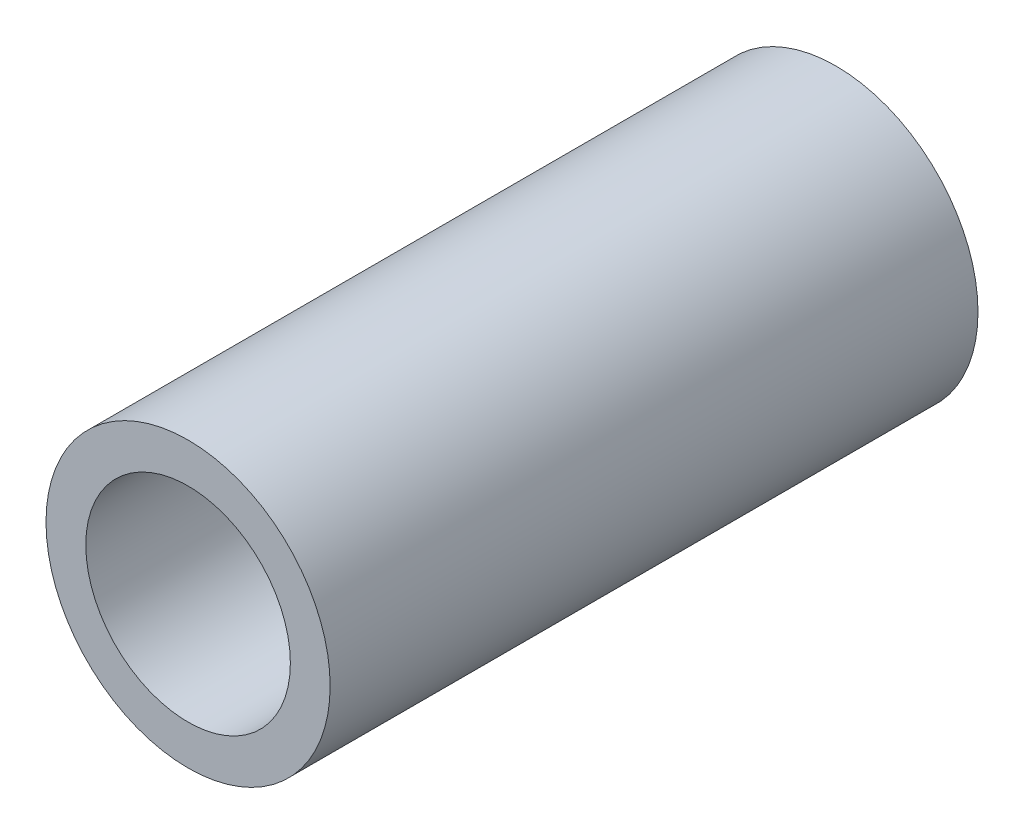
ISO-10303-21;
HEADER;
FILE_DESCRIPTION(('STEP AP214'),'2;1');
FILE_NAME('part.step','',(''),(''),'','','');
FILE_SCHEMA(('AUTOMOTIVE_DESIGN { 1 0 10303 214 1 1 1 1 }'));
ENDSEC;
DATA;
#1=APPLICATION_CONTEXT('core data for automotive mechanical design processes');
#2=APPLICATION_PROTOCOL_DEFINITION('international standard','automotive_design',2000,#1);
#3=PRODUCT_CONTEXT('',#1,'mechanical');
#4=PRODUCT('Part','Part','',(#3));
#5=PRODUCT_RELATED_PRODUCT_CATEGORY('part','',(#4));
#6=PRODUCT_DEFINITION_FORMATION('','',#4);
#7=PRODUCT_DEFINITION_CONTEXT('part definition',#1,'design');
#8=PRODUCT_DEFINITION('design','',#6,#7);
#9=PRODUCT_DEFINITION_SHAPE('','',#8);
#10=(LENGTH_UNIT() NAMED_UNIT(*) SI_UNIT(.MILLI.,.METRE.));
#11=(NAMED_UNIT(*) PLANE_ANGLE_UNIT() SI_UNIT($,.RADIAN.));
#12=(NAMED_UNIT(*) SI_UNIT($,.STERADIAN.) SOLID_ANGLE_UNIT());
#13=UNCERTAINTY_MEASURE_WITH_UNIT(LENGTH_MEASURE(1.E-05),#10,'distance_accuracy_value','');
#14=(GEOMETRIC_REPRESENTATION_CONTEXT(3) GLOBAL_UNCERTAINTY_ASSIGNED_CONTEXT((#13)) GLOBAL_UNIT_ASSIGNED_CONTEXT((#10,
#11,#12)) REPRESENTATION_CONTEXT('',''));
#15=CARTESIAN_POINT('',(0.,0.,0.));
#16=DIRECTION('',(0.,0.,1.));
#17=DIRECTION('',(1.,0.,0.));
#18=AXIS2_PLACEMENT_3D('',#15,#16,#17);
#19=CARTESIAN_POINT('',(0.,0.,28.5));
#20=DIRECTION('',(0.,0.,1.));
#21=DIRECTION('',(1.,0.,0.));
#22=AXIS2_PLACEMENT_3D('',#19,#20,#21);
#23=PLANE('',#22);
#24=CARTESIAN_POINT('',(0.,0.,28.5));
#25=DIRECTION('',(0.,0.,1.));
#26=DIRECTION('',(1.,0.,0.));
#27=AXIS2_PLACEMENT_3D('',#24,#25,#26);
#28=CIRCLE('',#27,12.5);
#29=CARTESIAN_POINT('',(-12.5,0.,28.5));
#30=VERTEX_POINT('',#29);
#31=EDGE_CURVE('E10',#30,#30,#28,.T.);
#32=ORIENTED_EDGE('',*,*,#31,.T.);
#33=EDGE_LOOP('',(#32));
#34=FACE_BOUND('',#33,.T.);
#35=CARTESIAN_POINT('',(0.,0.,28.5));
#36=DIRECTION('',(0.,0.,1.));
#37=DIRECTION('',(1.,0.,0.));
#38=AXIS2_PLACEMENT_3D('',#35,#36,#37);
#39=CIRCLE('',#38,9.);
#40=CARTESIAN_POINT('',(-9.,0.,28.5));
#41=VERTEX_POINT('',#40);
#42=EDGE_CURVE('E40',#41,#41,#39,.T.);
#43=ORIENTED_EDGE('',*,*,#42,.F.);
#44=EDGE_LOOP('',(#43));
#45=FACE_BOUND('',#44,.T.);
#46=ADVANCED_FACE('F29',(#34,#45),#23,.T.);
#47=CARTESIAN_POINT('',(0.,0.,-28.5));
#48=DIRECTION('',(0.,0.,1.));
#49=DIRECTION('',(1.,0.,0.));
#50=AXIS2_PLACEMENT_3D('',#47,#48,#49);
#51=PLANE('',#50);
#52=CARTESIAN_POINT('',(0.,0.,-28.5));
#53=DIRECTION('',(0.,0.,1.));
#54=DIRECTION('',(1.,0.,0.));
#55=AXIS2_PLACEMENT_3D('',#52,#53,#54);
#56=CIRCLE('',#55,12.5);
#57=CARTESIAN_POINT('',(-12.5,0.,-28.5));
#58=VERTEX_POINT('',#57);
#59=EDGE_CURVE('E33',#58,#58,#56,.T.);
#60=ORIENTED_EDGE('',*,*,#59,.F.);
#61=EDGE_LOOP('',(#60));
#62=FACE_BOUND('',#61,.T.);
#63=CARTESIAN_POINT('',(0.,0.,-28.5));
#64=DIRECTION('',(0.,0.,1.));
#65=DIRECTION('',(1.,0.,0.));
#66=AXIS2_PLACEMENT_3D('',#63,#64,#65);
#67=CIRCLE('',#66,9.);
#68=CARTESIAN_POINT('',(-9.,0.,-28.5));
#69=VERTEX_POINT('',#68);
#70=EDGE_CURVE('E42',#69,#69,#67,.T.);
#71=ORIENTED_EDGE('',*,*,#70,.T.);
#72=EDGE_LOOP('',(#71));
#73=FACE_BOUND('',#72,.T.);
#74=ADVANCED_FACE('F52',(#62,#73),#51,.F.);
#75=CARTESIAN_POINT('',(0.,0.,28.5));
#76=DIRECTION('',(0.,0.,-1.));
#77=DIRECTION('',(-1.,0.,0.));
#78=AXIS2_PLACEMENT_3D('',#75,#76,#77);
#79=CYLINDRICAL_SURFACE('',#78,12.5);
#80=CARTESIAN_POINT('',(-12.5,0.,28.5));
#81=CARTESIAN_POINT('',(-12.5,0.,27.90625));
#82=CARTESIAN_POINT('',(-12.5,0.,27.3125));
#83=CARTESIAN_POINT('',(-12.5,0.,26.125));
#84=CARTESIAN_POINT('',(-12.5,0.,25.53125));
#85=CARTESIAN_POINT('',(-12.5,0.,24.34375));
#86=CARTESIAN_POINT('',(-12.5,0.,23.75));
#87=CARTESIAN_POINT('',(-12.5,0.,22.5625));
#88=CARTESIAN_POINT('',(-12.5,0.,21.96875));
#89=CARTESIAN_POINT('',(-12.5,0.,20.78125));
#90=CARTESIAN_POINT('',(-12.5,0.,20.1875));
#91=CARTESIAN_POINT('',(-12.5,0.,19.));
#92=CARTESIAN_POINT('',(-12.5,0.,18.40625));
#93=CARTESIAN_POINT('',(-12.5,0.,17.21875));
#94=CARTESIAN_POINT('',(-12.5,0.,16.625));
#95=CARTESIAN_POINT('',(-12.5,0.,15.4375));
#96=CARTESIAN_POINT('',(-12.5,0.,14.84375));
#97=CARTESIAN_POINT('',(-12.5,0.,13.65625));
#98=CARTESIAN_POINT('',(-12.5,0.,13.0625));
#99=CARTESIAN_POINT('',(-12.5,0.,11.875));
#100=CARTESIAN_POINT('',(-12.5,0.,11.28125));
#101=CARTESIAN_POINT('',(-12.5,0.,10.09375));
#102=CARTESIAN_POINT('',(-12.5,0.,9.5));
#103=CARTESIAN_POINT('',(-12.5,0.,8.3125));
#104=CARTESIAN_POINT('',(-12.5,0.,7.71875));
#105=CARTESIAN_POINT('',(-12.5,0.,6.53125));
#106=CARTESIAN_POINT('',(-12.5,0.,5.9375));
#107=CARTESIAN_POINT('',(-12.5,0.,4.75));
#108=CARTESIAN_POINT('',(-12.5,0.,4.15625));
#109=CARTESIAN_POINT('',(-12.5,0.,2.96875));
#110=CARTESIAN_POINT('',(-12.5,0.,2.375));
#111=CARTESIAN_POINT('',(-12.5,0.,1.1875));
#112=CARTESIAN_POINT('',(-12.5,0.,0.593750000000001));
#113=CARTESIAN_POINT('',(-12.5,0.,-0.593750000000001));
#114=CARTESIAN_POINT('',(-12.5,0.,-1.1875));
#115=CARTESIAN_POINT('',(-12.5,0.,-2.375));
#116=CARTESIAN_POINT('',(-12.5,0.,-2.96875));
#117=CARTESIAN_POINT('',(-12.5,0.,-4.15625));
#118=CARTESIAN_POINT('',(-12.5,0.,-4.75));
#119=CARTESIAN_POINT('',(-12.5,0.,-5.9375));
#120=CARTESIAN_POINT('',(-12.5,0.,-6.53125));
#121=CARTESIAN_POINT('',(-12.5,0.,-7.71875));
#122=CARTESIAN_POINT('',(-12.5,0.,-8.3125));
#123=CARTESIAN_POINT('',(-12.5,0.,-9.5));
#124=CARTESIAN_POINT('',(-12.5,0.,-10.09375));
#125=CARTESIAN_POINT('',(-12.5,0.,-11.28125));
#126=CARTESIAN_POINT('',(-12.5,0.,-11.875));
#127=CARTESIAN_POINT('',(-12.5,0.,-13.0625));
#128=CARTESIAN_POINT('',(-12.5,0.,-13.65625));
#129=CARTESIAN_POINT('',(-12.5,0.,-14.84375));
#130=CARTESIAN_POINT('',(-12.5,0.,-15.4375));
#131=CARTESIAN_POINT('',(-12.5,0.,-16.625));
#132=CARTESIAN_POINT('',(-12.5,0.,-17.21875));
#133=CARTESIAN_POINT('',(-12.5,0.,-18.40625));
#134=CARTESIAN_POINT('',(-12.5,0.,-19.));
#135=CARTESIAN_POINT('',(-12.5,0.,-20.1875));
#136=CARTESIAN_POINT('',(-12.5,0.,-20.78125));
#137=CARTESIAN_POINT('',(-12.5,0.,-21.96875));
#138=CARTESIAN_POINT('',(-12.5,0.,-22.5625));
#139=CARTESIAN_POINT('',(-12.5,0.,-23.75));
#140=CARTESIAN_POINT('',(-12.5,0.,-24.34375));
#141=CARTESIAN_POINT('',(-12.5,0.,-25.53125));
#142=CARTESIAN_POINT('',(-12.5,0.,-26.125));
#143=CARTESIAN_POINT('',(-12.5,0.,-27.3125));
#144=CARTESIAN_POINT('',(-12.5,0.,-27.90625));
#145=CARTESIAN_POINT('',(-12.5,0.,-28.5));
#146=B_SPLINE_CURVE_WITH_KNOTS('',3,(#80,#81,#82,#83,#84,#85,#86,#87,#88,#89,#90,#91,#92,#93,
#94,#95,#96,#97,#98,#99,#100,#101,#102,#103,#104,#105,#106,#107,#108,#109,#110,#111,#112,#113,
#114,#115,#116,#117,#118,#119,#120,#121,#122,#123,#124,#125,#126,#127,#128,#129,#130,#131,#132,
#133,#134,#135,#136,#137,#138,#139,#140,#141,#142,#143,#144,#145),.UNSPECIFIED.,.F.,.F.,(4,2,2,
2,2,2,2,2,2,2,2,2,2,2,2,2,2,2,2,2,2,2,2,2,2,2,2,2,2,2,2,2,4),(0.,1.78125,3.5625,5.34375,7.125,
8.90625,10.6875,12.46875,14.25,16.03125,17.8125,19.59375,21.375,23.15625,24.9375,26.71875,28.5,
30.28125,32.0625,33.84375,35.625,37.40625,39.1875,40.96875,42.75,44.53125,46.3125,48.09375,
49.875,51.65625,53.4375,55.21875,57.),.UNSPECIFIED.);
#147=EDGE_CURVE('BSEAM31',#30,#58,#146,.T.);
#148=ORIENTED_EDGE('',*,*,#31,.F.);
#149=ORIENTED_EDGE('',*,*,#59,.T.);
#150=ORIENTED_EDGE('',*,*,#147,.T.);
#151=ORIENTED_EDGE('',*,*,#147,.F.);
#152=EDGE_LOOP('',(#148,#150,#149,#151));
#153=FACE_BOUND('',#152,.T.);
#154=ADVANCED_FACE('F31',(#153),#79,.T.);
#155=CARTESIAN_POINT('',(0.,0.,28.5));
#156=DIRECTION('',(0.,0.,-1.));
#157=DIRECTION('',(-1.,0.,0.));
#158=AXIS2_PLACEMENT_3D('',#155,#156,#157);
#159=CYLINDRICAL_SURFACE('',#158,9.);
#160=CARTESIAN_POINT('',(-9.,0.,28.5));
#161=CARTESIAN_POINT('',(-9.,0.,27.90625));
#162=CARTESIAN_POINT('',(-9.,0.,27.3125));
#163=CARTESIAN_POINT('',(-9.,0.,26.125));
#164=CARTESIAN_POINT('',(-9.,0.,25.53125));
#165=CARTESIAN_POINT('',(-9.,0.,24.34375));
#166=CARTESIAN_POINT('',(-9.,0.,23.75));
#167=CARTESIAN_POINT('',(-9.,0.,22.5625));
#168=CARTESIAN_POINT('',(-9.,0.,21.96875));
#169=CARTESIAN_POINT('',(-9.,0.,20.78125));
#170=CARTESIAN_POINT('',(-9.,0.,20.1875));
#171=CARTESIAN_POINT('',(-9.,0.,19.));
#172=CARTESIAN_POINT('',(-9.,0.,18.40625));
#173=CARTESIAN_POINT('',(-9.,0.,17.21875));
#174=CARTESIAN_POINT('',(-9.,0.,16.625));
#175=CARTESIAN_POINT('',(-9.,0.,15.4375));
#176=CARTESIAN_POINT('',(-9.,0.,14.84375));
#177=CARTESIAN_POINT('',(-9.,0.,13.65625));
#178=CARTESIAN_POINT('',(-9.,0.,13.0625));
#179=CARTESIAN_POINT('',(-9.,0.,11.875));
#180=CARTESIAN_POINT('',(-9.,0.,11.28125));
#181=CARTESIAN_POINT('',(-9.,0.,10.09375));
#182=CARTESIAN_POINT('',(-9.,0.,9.5));
#183=CARTESIAN_POINT('',(-9.,0.,8.3125));
#184=CARTESIAN_POINT('',(-9.,0.,7.71875));
#185=CARTESIAN_POINT('',(-9.,0.,6.53125));
#186=CARTESIAN_POINT('',(-9.,0.,5.9375));
#187=CARTESIAN_POINT('',(-9.,0.,4.75));
#188=CARTESIAN_POINT('',(-9.,0.,4.15625));
#189=CARTESIAN_POINT('',(-9.,0.,2.96875));
#190=CARTESIAN_POINT('',(-9.,0.,2.375));
#191=CARTESIAN_POINT('',(-9.,0.,1.1875));
#192=CARTESIAN_POINT('',(-9.,0.,0.593750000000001));
#193=CARTESIAN_POINT('',(-9.,0.,-0.593750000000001));
#194=CARTESIAN_POINT('',(-9.,0.,-1.1875));
#195=CARTESIAN_POINT('',(-9.,0.,-2.375));
#196=CARTESIAN_POINT('',(-9.,0.,-2.96875));
#197=CARTESIAN_POINT('',(-9.,0.,-4.15625));
#198=CARTESIAN_POINT('',(-9.,0.,-4.75));
#199=CARTESIAN_POINT('',(-9.,0.,-5.9375));
#200=CARTESIAN_POINT('',(-9.,0.,-6.53125));
#201=CARTESIAN_POINT('',(-9.,0.,-7.71875));
#202=CARTESIAN_POINT('',(-9.,0.,-8.3125));
#203=CARTESIAN_POINT('',(-9.,0.,-9.5));
#204=CARTESIAN_POINT('',(-9.,0.,-10.09375));
#205=CARTESIAN_POINT('',(-9.,0.,-11.28125));
#206=CARTESIAN_POINT('',(-9.,0.,-11.875));
#207=CARTESIAN_POINT('',(-9.,0.,-13.0625));
#208=CARTESIAN_POINT('',(-9.,0.,-13.65625));
#209=CARTESIAN_POINT('',(-9.,0.,-14.84375));
#210=CARTESIAN_POINT('',(-9.,0.,-15.4375));
#211=CARTESIAN_POINT('',(-9.,0.,-16.625));
#212=CARTESIAN_POINT('',(-9.,0.,-17.21875));
#213=CARTESIAN_POINT('',(-9.,0.,-18.40625));
#214=CARTESIAN_POINT('',(-9.,0.,-19.));
#215=CARTESIAN_POINT('',(-9.,0.,-20.1875));
#216=CARTESIAN_POINT('',(-9.,0.,-20.78125));
#217=CARTESIAN_POINT('',(-9.,0.,-21.96875));
#218=CARTESIAN_POINT('',(-9.,0.,-22.5625));
#219=CARTESIAN_POINT('',(-9.,0.,-23.75));
#220=CARTESIAN_POINT('',(-9.,0.,-24.34375));
#221=CARTESIAN_POINT('',(-9.,0.,-25.53125));
#222=CARTESIAN_POINT('',(-9.,0.,-26.125));
#223=CARTESIAN_POINT('',(-9.,0.,-27.3125));
#224=CARTESIAN_POINT('',(-9.,0.,-27.90625));
#225=CARTESIAN_POINT('',(-9.,0.,-28.5));
#226=B_SPLINE_CURVE_WITH_KNOTS('',3,(#160,#161,#162,#163,#164,#165,#166,#167,#168,#169,#170,
#171,#172,#173,#174,#175,#176,#177,#178,#179,#180,#181,#182,#183,#184,#185,#186,#187,#188,#189,
#190,#191,#192,#193,#194,#195,#196,#197,#198,#199,#200,#201,#202,#203,#204,#205,#206,#207,#208,
#209,#210,#211,#212,#213,#214,#215,#216,#217,#218,#219,#220,#221,#222,#223,#224,#225),
.UNSPECIFIED.,.F.,.F.,(4,2,2,2,2,2,2,2,2,2,2,2,2,2,2,2,2,2,2,2,2,2,2,2,2,2,2,2,2,2,2,2,4),(0.,
1.78125,3.5625,5.34375,7.125,8.90625,10.6875,12.46875,14.25,16.03125,17.8125,19.59375,21.375,
23.15625,24.9375,26.71875,28.5,30.28125,32.0625,33.84375,35.625,37.40625,39.1875,40.96875,42.75,
44.53125,46.3125,48.09375,49.875,51.65625,53.4375,55.21875,57.),.UNSPECIFIED.);
#227=EDGE_CURVE('BSEAM48',#41,#69,#226,.T.);
#228=ORIENTED_EDGE('',*,*,#42,.T.);
#229=ORIENTED_EDGE('',*,*,#70,.F.);
#230=ORIENTED_EDGE('',*,*,#227,.T.);
#231=ORIENTED_EDGE('',*,*,#227,.F.);
#232=EDGE_LOOP('',(#228,#230,#229,#231));
#233=FACE_BOUND('',#232,.T.);
#234=ADVANCED_FACE('F48',(#233),#159,.F.);
#235=CLOSED_SHELL('',(#46,#74,#154,#234));
#236=MANIFOLD_SOLID_BREP('B2',#235);
#237=ADVANCED_BREP_SHAPE_REPRESENTATION('',(#18,#236),#14);
#238=SHAPE_DEFINITION_REPRESENTATION(#9,#237);
ENDSEC;
END-ISO-10303-21;
